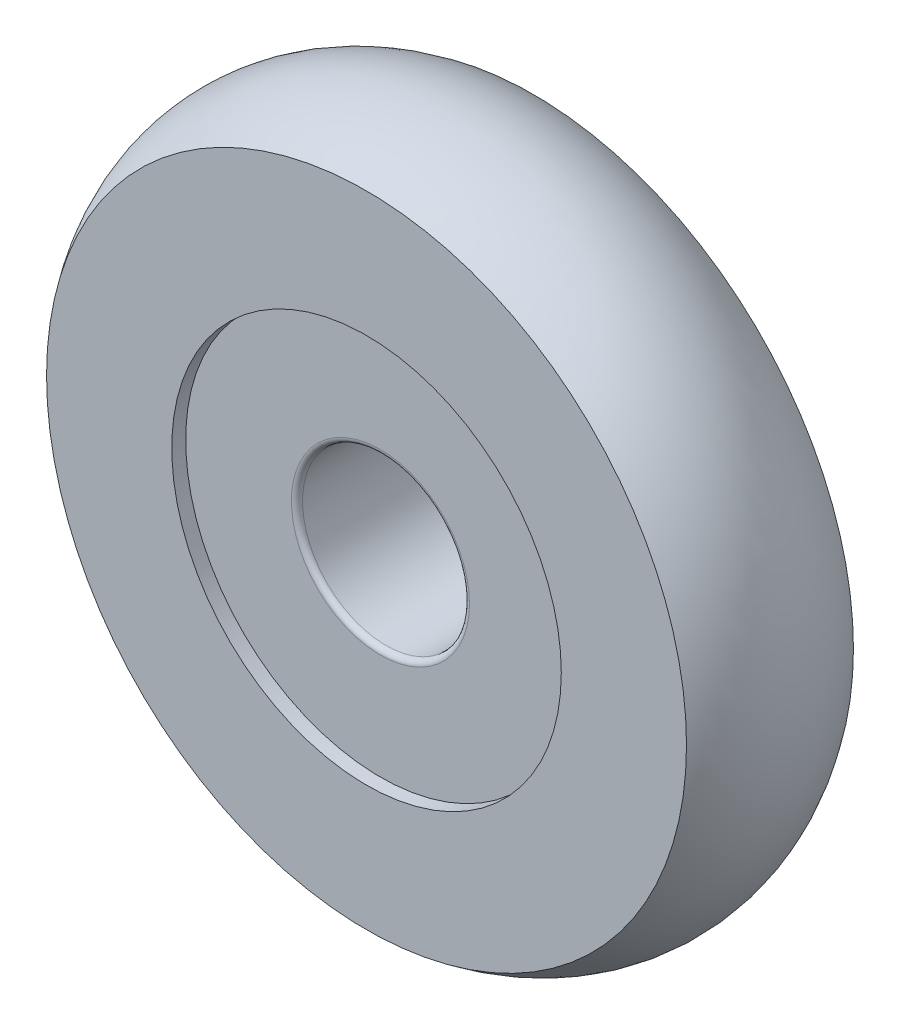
ISO-10303-21;
HEADER;
FILE_DESCRIPTION(('STEP AP214'),'2;1');
FILE_NAME('part.step','',(''),(''),'','','');
FILE_SCHEMA(('AUTOMOTIVE_DESIGN { 1 0 10303 214 1 1 1 1 }'));
ENDSEC;
DATA;
#1=APPLICATION_CONTEXT('core data for automotive mechanical design processes');
#2=APPLICATION_PROTOCOL_DEFINITION('international standard','automotive_design',2000,#1);
#3=PRODUCT_CONTEXT('',#1,'mechanical');
#4=PRODUCT('Part','Part','',(#3));
#5=PRODUCT_RELATED_PRODUCT_CATEGORY('part','',(#4));
#6=PRODUCT_DEFINITION_FORMATION('','',#4);
#7=PRODUCT_DEFINITION_CONTEXT('part definition',#1,'design');
#8=PRODUCT_DEFINITION('design','',#6,#7);
#9=PRODUCT_DEFINITION_SHAPE('','',#8);
#10=(LENGTH_UNIT() NAMED_UNIT(*) SI_UNIT(.MILLI.,.METRE.));
#11=(NAMED_UNIT(*) PLANE_ANGLE_UNIT() SI_UNIT($,.RADIAN.));
#12=(NAMED_UNIT(*) SI_UNIT($,.STERADIAN.) SOLID_ANGLE_UNIT());
#13=UNCERTAINTY_MEASURE_WITH_UNIT(LENGTH_MEASURE(1.E-05),#10,'distance_accuracy_value','');
#14=(GEOMETRIC_REPRESENTATION_CONTEXT(3) GLOBAL_UNCERTAINTY_ASSIGNED_CONTEXT((#13)) GLOBAL_UNIT_ASSIGNED_CONTEXT((#10,
#11,#12)) REPRESENTATION_CONTEXT('',''));
#15=CARTESIAN_POINT('',(0.,0.,0.));
#16=DIRECTION('',(0.,0.,1.));
#17=DIRECTION('',(1.,0.,0.));
#18=AXIS2_PLACEMENT_3D('',#15,#16,#17);
#19=CARTESIAN_POINT('',(0.,0.,2.30000000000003));
#20=DIRECTION('',(0.,0.,1.));
#21=DIRECTION('',(1.,0.,0.));
#22=AXIS2_PLACEMENT_3D('',#19,#20,#21);
#23=TOROIDAL_SURFACE('',#22,3.2,0.199999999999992);
#24=CARTESIAN_POINT('',(0.,0.,2.30000000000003));
#25=DIRECTION('',(0.,0.,1.));
#26=DIRECTION('',(1.,0.,0.));
#27=AXIS2_PLACEMENT_3D('',#24,#25,#26);
#28=CIRCLE('',#27,3.);
#29=CARTESIAN_POINT('',(3.,0.,2.30000000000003));
#30=VERTEX_POINT('',#29);
#31=EDGE_CURVE('E8',#30,#30,#28,.T.);
#32=ORIENTED_EDGE('',*,*,#31,.F.);
#33=EDGE_LOOP('',(#32));
#34=FACE_BOUND('',#33,.T.);
#35=CARTESIAN_POINT('',(0.,0.,2.5));
#36=DIRECTION('',(0.,0.,1.));
#37=DIRECTION('',(1.,0.,0.));
#38=AXIS2_PLACEMENT_3D('',#35,#36,#37);
#39=CIRCLE('',#38,3.2);
#40=CARTESIAN_POINT('',(3.2,0.,2.5));
#41=VERTEX_POINT('',#40);
#42=EDGE_CURVE('E46',#41,#41,#39,.T.);
#43=ORIENTED_EDGE('',*,*,#42,.T.);
#44=EDGE_LOOP('',(#43));
#45=FACE_BOUND('',#44,.T.);
#46=ADVANCED_FACE('F12',(#34,#45),#23,.T.);
#47=CARTESIAN_POINT('',(0.,0.,6.));
#48=DIRECTION('',(0.,0.,1.));
#49=DIRECTION('',(1.,0.,0.));
#50=AXIS2_PLACEMENT_3D('',#47,#48,#49);
#51=CYLINDRICAL_SURFACE('',#50,3.);
#52=CARTESIAN_POINT('',(0.,0.,-2.3));
#53=DIRECTION('',(0.,0.,1.));
#54=DIRECTION('',(1.,0.,0.));
#55=AXIS2_PLACEMENT_3D('',#52,#53,#54);
#56=CIRCLE('',#55,3.);
#57=CARTESIAN_POINT('',(3.,0.,-2.3));
#58=VERTEX_POINT('',#57);
#59=EDGE_CURVE('E18',#58,#58,#56,.T.);
#60=ORIENTED_EDGE('',*,*,#59,.F.);
#61=EDGE_LOOP('',(#60));
#62=FACE_BOUND('',#61,.T.);
#63=ORIENTED_EDGE('',*,*,#31,.T.);
#64=EDGE_LOOP('',(#63));
#65=FACE_BOUND('',#64,.T.);
#66=ADVANCED_FACE('F95',(#62,#65),#51,.F.);
#67=CARTESIAN_POINT('',(0.,0.,-2.3));
#68=DIRECTION('',(0.,0.,1.));
#69=DIRECTION('',(1.,0.,0.));
#70=AXIS2_PLACEMENT_3D('',#67,#68,#69);
#71=TOROIDAL_SURFACE('',#70,3.2,0.200000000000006);
#72=CARTESIAN_POINT('',(0.,0.,-2.5));
#73=DIRECTION('',(0.,0.,1.));
#74=DIRECTION('',(1.,0.,0.));
#75=AXIS2_PLACEMENT_3D('',#72,#73,#74);
#76=CIRCLE('',#75,3.2);
#77=CARTESIAN_POINT('',(3.2,0.,-2.5));
#78=VERTEX_POINT('',#77);
#79=EDGE_CURVE('E22',#78,#78,#76,.T.);
#80=ORIENTED_EDGE('',*,*,#79,.F.);
#81=EDGE_LOOP('',(#80));
#82=FACE_BOUND('',#81,.T.);
#83=ORIENTED_EDGE('',*,*,#59,.T.);
#84=EDGE_LOOP('',(#83));
#85=FACE_BOUND('',#84,.T.);
#86=ADVANCED_FACE('F90',(#82,#85),#71,.T.);
#87=CARTESIAN_POINT('',(0.,3.2,-2.5));
#88=DIRECTION('',(0.,0.,1.));
#89=DIRECTION('',(1.,0.,0.));
#90=AXIS2_PLACEMENT_3D('',#87,#88,#89);
#91=PLANE('',#90);
#92=CARTESIAN_POINT('',(0.,0.,-2.5));
#93=DIRECTION('',(0.,0.,1.));
#94=DIRECTION('',(1.,0.,0.));
#95=AXIS2_PLACEMENT_3D('',#92,#93,#94);
#96=CIRCLE('',#95,7.);
#97=CARTESIAN_POINT('',(7.,0.,-2.5));
#98=VERTEX_POINT('',#97);
#99=EDGE_CURVE('E26',#98,#98,#96,.T.);
#100=ORIENTED_EDGE('',*,*,#99,.F.);
#101=EDGE_LOOP('',(#100));
#102=FACE_BOUND('',#101,.T.);
#103=ORIENTED_EDGE('',*,*,#79,.T.);
#104=EDGE_LOOP('',(#103));
#105=FACE_BOUND('',#104,.T.);
#106=ADVANCED_FACE('F84',(#102,#105),#91,.F.);
#107=CARTESIAN_POINT('',(0.,0.,6.));
#108=DIRECTION('',(0.,0.,1.));
#109=DIRECTION('',(1.,0.,0.));
#110=AXIS2_PLACEMENT_3D('',#107,#108,#109);
#111=CYLINDRICAL_SURFACE('',#110,7.);
#112=CARTESIAN_POINT('',(0.,0.,-3.));
#113=DIRECTION('',(0.,0.,1.));
#114=DIRECTION('',(1.,0.,0.));
#115=AXIS2_PLACEMENT_3D('',#112,#113,#114);
#116=CIRCLE('',#115,7.);
#117=CARTESIAN_POINT('',(7.,0.,-3.));
#118=VERTEX_POINT('',#117);
#119=EDGE_CURVE('E31',#118,#118,#116,.T.);
#120=ORIENTED_EDGE('',*,*,#119,.F.);
#121=EDGE_LOOP('',(#120));
#122=FACE_BOUND('',#121,.T.);
#123=ORIENTED_EDGE('',*,*,#99,.T.);
#124=EDGE_LOOP('',(#123));
#125=FACE_BOUND('',#124,.T.);
#126=ADVANCED_FACE('F78',(#122,#125),#111,.F.);
#127=CARTESIAN_POINT('',(0.,11.5,-3.));
#128=DIRECTION('',(0.,0.,1.));
#129=DIRECTION('',(1.,0.,0.));
#130=AXIS2_PLACEMENT_3D('',#127,#128,#129);
#131=PLANE('',#130);
#132=CARTESIAN_POINT('',(0.,0.,-3.));
#133=DIRECTION('',(0.,0.,1.));
#134=DIRECTION('',(1.,0.,0.));
#135=AXIS2_PLACEMENT_3D('',#132,#133,#134);
#136=CIRCLE('',#135,11.5);
#137=CARTESIAN_POINT('',(11.5,0.,-3.));
#138=VERTEX_POINT('',#137);
#139=EDGE_CURVE('E34',#138,#138,#136,.T.);
#140=ORIENTED_EDGE('',*,*,#139,.F.);
#141=EDGE_LOOP('',(#140));
#142=FACE_BOUND('',#141,.T.);
#143=ORIENTED_EDGE('',*,*,#119,.T.);
#144=EDGE_LOOP('',(#143));
#145=FACE_BOUND('',#144,.T.);
#146=ADVANCED_FACE('F72',(#142,#145),#131,.F.);
#147=CARTESIAN_POINT('',(0.,0.,0.));
#148=DIRECTION('',(0.,0.,1.));
#149=DIRECTION('',(1.,0.,0.));
#150=AXIS2_PLACEMENT_3D('',#147,#148,#149);
#151=TOROIDAL_SURFACE('',#150,7.5,5.);
#152=CARTESIAN_POINT('',(0.,0.,3.));
#153=DIRECTION('',(0.,0.,1.));
#154=DIRECTION('',(1.,0.,0.));
#155=AXIS2_PLACEMENT_3D('',#152,#153,#154);
#156=CIRCLE('',#155,11.5);
#157=CARTESIAN_POINT('',(11.5,0.,3.));
#158=VERTEX_POINT('',#157);
#159=EDGE_CURVE('E37',#158,#158,#156,.T.);
#160=ORIENTED_EDGE('',*,*,#159,.F.);
#161=EDGE_LOOP('',(#160));
#162=FACE_BOUND('',#161,.T.);
#163=ORIENTED_EDGE('',*,*,#139,.T.);
#164=EDGE_LOOP('',(#163));
#165=FACE_BOUND('',#164,.T.);
#166=ADVANCED_FACE('F66',(#162,#165),#151,.T.);
#167=CARTESIAN_POINT('',(0.,11.5,3.));
#168=DIRECTION('',(0.,0.,-1.));
#169=DIRECTION('',(-1.,0.,0.));
#170=AXIS2_PLACEMENT_3D('',#167,#168,#169);
#171=PLANE('',#170);
#172=CARTESIAN_POINT('',(0.,0.,3.));
#173=DIRECTION('',(0.,0.,1.));
#174=DIRECTION('',(1.,0.,0.));
#175=AXIS2_PLACEMENT_3D('',#172,#173,#174);
#176=CIRCLE('',#175,7.);
#177=CARTESIAN_POINT('',(7.,0.,3.));
#178=VERTEX_POINT('',#177);
#179=EDGE_CURVE('E40',#178,#178,#176,.T.);
#180=ORIENTED_EDGE('',*,*,#179,.F.);
#181=EDGE_LOOP('',(#180));
#182=FACE_BOUND('',#181,.T.);
#183=ORIENTED_EDGE('',*,*,#159,.T.);
#184=EDGE_LOOP('',(#183));
#185=FACE_BOUND('',#184,.T.);
#186=ADVANCED_FACE('F60',(#182,#185),#171,.F.);
#187=CARTESIAN_POINT('',(0.,0.,6.));
#188=DIRECTION('',(0.,0.,1.));
#189=DIRECTION('',(1.,0.,0.));
#190=AXIS2_PLACEMENT_3D('',#187,#188,#189);
#191=CYLINDRICAL_SURFACE('',#190,7.);
#192=CARTESIAN_POINT('',(0.,0.,2.5));
#193=DIRECTION('',(0.,0.,1.));
#194=DIRECTION('',(1.,0.,0.));
#195=AXIS2_PLACEMENT_3D('',#192,#193,#194);
#196=CIRCLE('',#195,7.);
#197=CARTESIAN_POINT('',(7.,0.,2.5));
#198=VERTEX_POINT('',#197);
#199=EDGE_CURVE('E43',#198,#198,#196,.T.);
#200=ORIENTED_EDGE('',*,*,#199,.F.);
#201=EDGE_LOOP('',(#200));
#202=FACE_BOUND('',#201,.T.);
#203=ORIENTED_EDGE('',*,*,#179,.T.);
#204=EDGE_LOOP('',(#203));
#205=FACE_BOUND('',#204,.T.);
#206=ADVANCED_FACE('F54',(#202,#205),#191,.F.);
#207=CARTESIAN_POINT('',(0.,3.2,2.5));
#208=DIRECTION('',(0.,0.,-1.));
#209=DIRECTION('',(-1.,0.,0.));
#210=AXIS2_PLACEMENT_3D('',#207,#208,#209);
#211=PLANE('',#210);
#212=ORIENTED_EDGE('',*,*,#42,.F.);
#213=EDGE_LOOP('',(#212));
#214=FACE_BOUND('',#213,.T.);
#215=ORIENTED_EDGE('',*,*,#199,.T.);
#216=EDGE_LOOP('',(#215));
#217=FACE_BOUND('',#216,.T.);
#218=ADVANCED_FACE('F51',(#214,#217),#211,.F.);
#219=CLOSED_SHELL('',(#46,#66,#86,#106,#126,#146,#166,#186,#206,#218));
#220=MANIFOLD_SOLID_BREP('B1',#219);
#221=ADVANCED_BREP_SHAPE_REPRESENTATION('',(#18,#220),#14);
#222=SHAPE_DEFINITION_REPRESENTATION(#9,#221);
ENDSEC;
END-ISO-10303-21;
